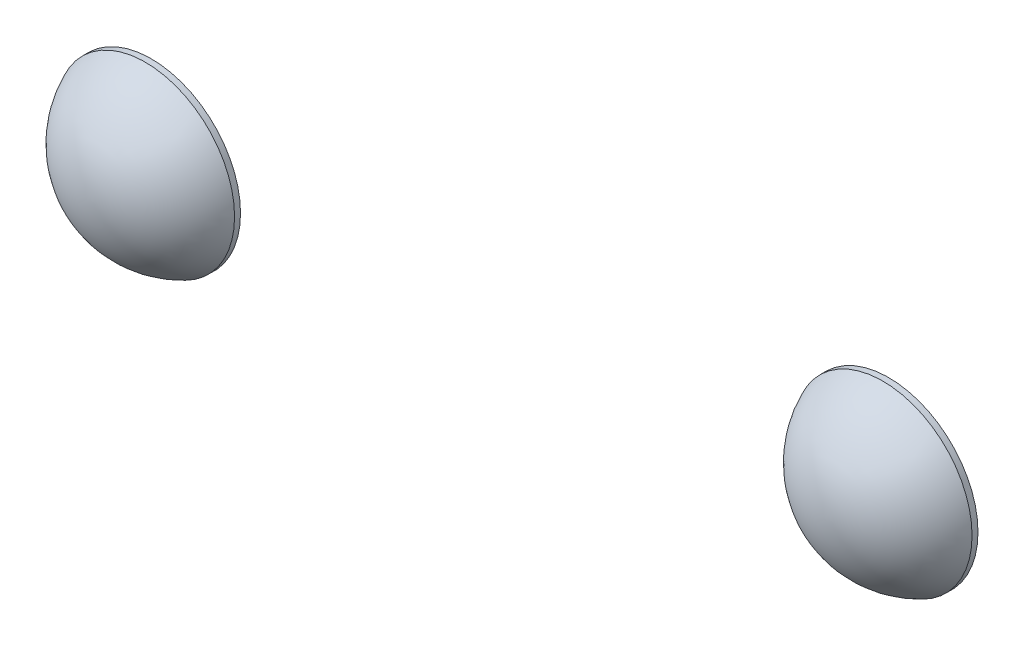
ISO-10303-21;
HEADER;
FILE_DESCRIPTION(('STEP AP214'),'2;1');
FILE_NAME('part.step','',(''),(''),'','','');
FILE_SCHEMA(('AUTOMOTIVE_DESIGN { 1 0 10303 214 1 1 1 1 }'));
ENDSEC;
DATA;
#1=APPLICATION_CONTEXT('core data for automotive mechanical design processes');
#2=APPLICATION_PROTOCOL_DEFINITION('international standard','automotive_design',2000,#1);
#3=PRODUCT_CONTEXT('',#1,'mechanical');
#4=PRODUCT('Part','Part','',(#3));
#5=PRODUCT_RELATED_PRODUCT_CATEGORY('part','',(#4));
#6=PRODUCT_DEFINITION_FORMATION('','',#4);
#7=PRODUCT_DEFINITION_CONTEXT('part definition',#1,'design');
#8=PRODUCT_DEFINITION('design','',#6,#7);
#9=PRODUCT_DEFINITION_SHAPE('','',#8);
#10=(LENGTH_UNIT() NAMED_UNIT(*) SI_UNIT(.MILLI.,.METRE.));
#11=(NAMED_UNIT(*) PLANE_ANGLE_UNIT() SI_UNIT($,.RADIAN.));
#12=(NAMED_UNIT(*) SI_UNIT($,.STERADIAN.) SOLID_ANGLE_UNIT());
#13=UNCERTAINTY_MEASURE_WITH_UNIT(LENGTH_MEASURE(1.E-05),#10,'distance_accuracy_value','');
#14=(GEOMETRIC_REPRESENTATION_CONTEXT(3) GLOBAL_UNCERTAINTY_ASSIGNED_CONTEXT((#13)) GLOBAL_UNIT_ASSIGNED_CONTEXT((#10,
#11,#12)) REPRESENTATION_CONTEXT('',''));
#15=CARTESIAN_POINT('',(0.,0.,0.));
#16=DIRECTION('',(0.,0.,1.));
#17=DIRECTION('',(1.,0.,0.));
#18=AXIS2_PLACEMENT_3D('',#15,#16,#17);
#19=CARTESIAN_POINT('',(-25.,0.,-9.39999998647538));
#20=DIRECTION('',(0.,0.,1.));
#21=DIRECTION('',(1.,0.,0.));
#22=AXIS2_PLACEMENT_3D('',#19,#20,#21);
#23=CYLINDRICAL_SURFACE('',#22,3.);
#24=CARTESIAN_POINT('',(-25.,0.,-9.39999998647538));
#25=DIRECTION('',(0.,0.,1.));
#26=DIRECTION('',(1.,0.,0.));
#27=AXIS2_PLACEMENT_3D('',#24,#25,#26);
#28=CIRCLE('',#27,3.);
#29=CARTESIAN_POINT('',(-22.,0.,-9.39999998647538));
#30=VERTEX_POINT('',#29);
#31=EDGE_CURVE('E11',#30,#30,#28,.T.);
#32=ORIENTED_EDGE('',*,*,#31,.T.);
#33=EDGE_LOOP('',(#32));
#34=FACE_BOUND('',#33,.T.);
#35=CARTESIAN_POINT('',(-25.,0.,-9.19999998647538));
#36=DIRECTION('',(0.,0.,1.));
#37=DIRECTION('',(1.,0.,0.));
#38=AXIS2_PLACEMENT_3D('',#35,#36,#37);
#39=CIRCLE('',#38,3.);
#40=CARTESIAN_POINT('',(-22.,0.,-9.19999998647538));
#41=VERTEX_POINT('',#40);
#42=EDGE_CURVE('E41',#41,#41,#39,.T.);
#43=ORIENTED_EDGE('',*,*,#42,.F.);
#44=EDGE_LOOP('',(#43));
#45=FACE_BOUND('',#44,.T.);
#46=ADVANCED_FACE('F37',(#34,#45),#23,.T.);
#47=CARTESIAN_POINT('',(-25.,0.,-9.39999998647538));
#48=DIRECTION('',(0.,0.,1.));
#49=DIRECTION('',(1.,0.,0.));
#50=AXIS2_PLACEMENT_3D('',#47,#48,#49);
#51=PLANE('',#50);
#52=ORIENTED_EDGE('',*,*,#31,.F.);
#53=EDGE_LOOP('',(#52));
#54=FACE_BOUND('',#53,.T.);
#55=ADVANCED_FACE('F52',(#54),#51,.F.);
#56=CARTESIAN_POINT('',(-25.,0.,-10.4499999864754));
#57=DIRECTION('',(0.,0.,1.));
#58=DIRECTION('',(1.,0.,0.));
#59=AXIS2_PLACEMENT_3D('',#56,#57,#58);
#60=SPHERICAL_SURFACE('',#59,3.25);
#61=ORIENTED_EDGE('',*,*,#42,.T.);
#62=EDGE_LOOP('',(#61));
#63=FACE_BOUND('',#62,.T.);
#64=ADVANCED_FACE('F39',(#63),#60,.T.);
#65=CLOSED_SHELL('',(#46,#55,#64));
#66=MANIFOLD_SOLID_BREP('B2',#65);
#67=CARTESIAN_POINT('',(-0.194783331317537,3.11467911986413,-9.39999998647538));
#68=DIRECTION('',(0.,0.,1.));
#69=DIRECTION('',(1.,0.,0.));
#70=AXIS2_PLACEMENT_3D('',#67,#68,#69);
#71=CYLINDRICAL_SURFACE('',#70,3.);
#72=CARTESIAN_POINT('',(-0.194783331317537,3.11467911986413,-9.39999998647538));
#73=DIRECTION('',(0.,0.,1.));
#74=DIRECTION('',(1.,0.,0.));
#75=AXIS2_PLACEMENT_3D('',#72,#73,#74);
#76=CIRCLE('',#75,3.);
#77=CARTESIAN_POINT('',(2.80521666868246,3.11467911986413,-9.39999998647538));
#78=VERTEX_POINT('',#77);
#79=EDGE_CURVE('E36',#78,#78,#76,.T.);
#80=ORIENTED_EDGE('',*,*,#79,.T.);
#81=EDGE_LOOP('',(#80));
#82=FACE_BOUND('',#81,.T.);
#83=CARTESIAN_POINT('',(-0.194783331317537,3.11467911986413,-9.19999998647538));
#84=DIRECTION('',(0.,0.,1.));
#85=DIRECTION('',(1.,0.,0.));
#86=AXIS2_PLACEMENT_3D('',#83,#84,#85);
#87=CIRCLE('',#86,3.);
#88=CARTESIAN_POINT('',(2.80521666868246,3.11467911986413,-9.19999998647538));
#89=VERTEX_POINT('',#88);
#90=EDGE_CURVE('E82',#89,#89,#87,.T.);
#91=ORIENTED_EDGE('',*,*,#90,.F.);
#92=EDGE_LOOP('',(#91));
#93=FACE_BOUND('',#92,.T.);
#94=ADVANCED_FACE('F78',(#82,#93),#71,.T.);
#95=CARTESIAN_POINT('',(-0.194783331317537,3.11467911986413,-9.39999998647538));
#96=DIRECTION('',(0.,0.,1.));
#97=DIRECTION('',(1.,0.,0.));
#98=AXIS2_PLACEMENT_3D('',#95,#96,#97);
#99=PLANE('',#98);
#100=ORIENTED_EDGE('',*,*,#79,.F.);
#101=EDGE_LOOP('',(#100));
#102=FACE_BOUND('',#101,.T.);
#103=ADVANCED_FACE('F93',(#102),#99,.F.);
#104=CARTESIAN_POINT('',(-0.194783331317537,3.11467911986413,-10.4499999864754));
#105=DIRECTION('',(0.,0.,1.));
#106=DIRECTION('',(1.,0.,0.));
#107=AXIS2_PLACEMENT_3D('',#104,#105,#106);
#108=SPHERICAL_SURFACE('',#107,3.25);
#109=ORIENTED_EDGE('',*,*,#90,.T.);
#110=EDGE_LOOP('',(#109));
#111=FACE_BOUND('',#110,.T.);
#112=ADVANCED_FACE('F80',(#111),#108,.T.);
#113=CLOSED_SHELL('',(#94,#103,#112));
#114=MANIFOLD_SOLID_BREP('B6',#113);
#115=ADVANCED_BREP_SHAPE_REPRESENTATION('',(#18,#66,#114),#14);
#116=SHAPE_DEFINITION_REPRESENTATION(#9,#115);
ENDSEC;
END-ISO-10303-21;
